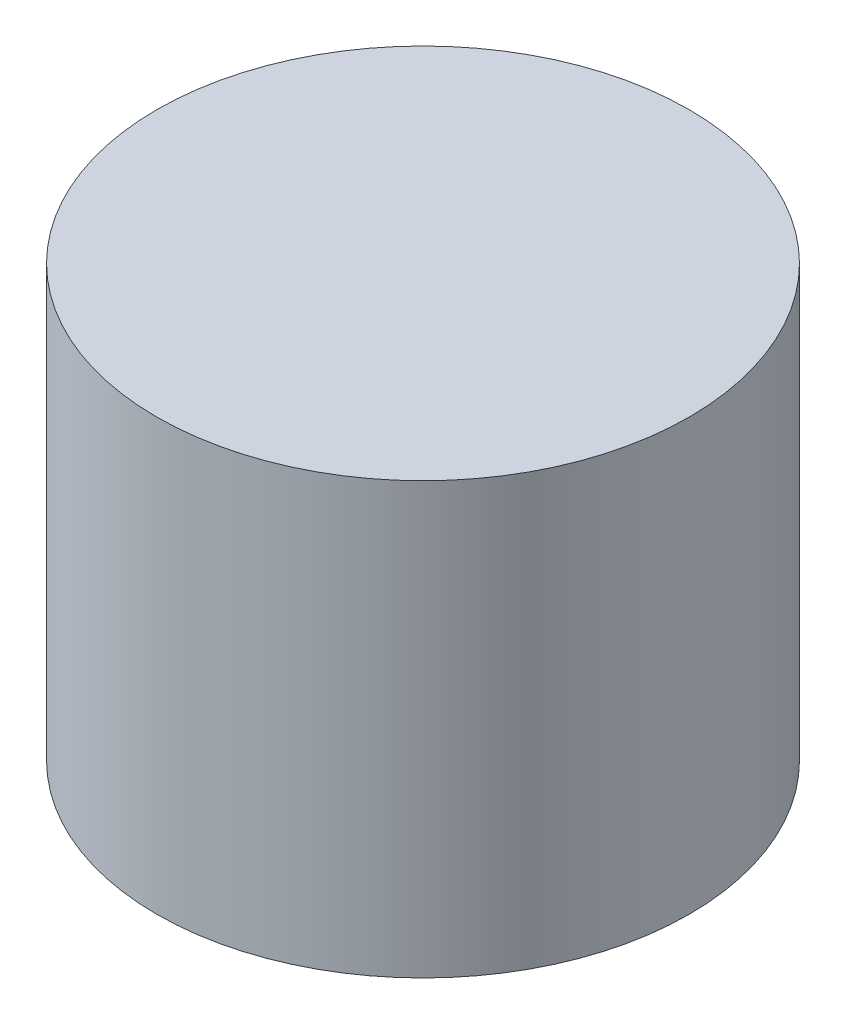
ISO-10303-21;
HEADER;
FILE_DESCRIPTION(('STEP AP214'),'2;1');
FILE_NAME('part.step','',(''),(''),'','','');
FILE_SCHEMA(('AUTOMOTIVE_DESIGN { 1 0 10303 214 1 1 1 1 }'));
ENDSEC;
DATA;
#1=APPLICATION_CONTEXT('core data for automotive mechanical design processes');
#2=APPLICATION_PROTOCOL_DEFINITION('international standard','automotive_design',2000,#1);
#3=PRODUCT_CONTEXT('',#1,'mechanical');
#4=PRODUCT('Part','Part','',(#3));
#5=PRODUCT_RELATED_PRODUCT_CATEGORY('part','',(#4));
#6=PRODUCT_DEFINITION_FORMATION('','',#4);
#7=PRODUCT_DEFINITION_CONTEXT('part definition',#1,'design');
#8=PRODUCT_DEFINITION('design','',#6,#7);
#9=PRODUCT_DEFINITION_SHAPE('','',#8);
#10=(LENGTH_UNIT() NAMED_UNIT(*) SI_UNIT(.MILLI.,.METRE.));
#11=(NAMED_UNIT(*) PLANE_ANGLE_UNIT() SI_UNIT($,.RADIAN.));
#12=(NAMED_UNIT(*) SI_UNIT($,.STERADIAN.) SOLID_ANGLE_UNIT());
#13=UNCERTAINTY_MEASURE_WITH_UNIT(LENGTH_MEASURE(1.E-05),#10,'distance_accuracy_value','');
#14=(GEOMETRIC_REPRESENTATION_CONTEXT(3) GLOBAL_UNCERTAINTY_ASSIGNED_CONTEXT((#13)) GLOBAL_UNIT_ASSIGNED_CONTEXT((#10,
#11,#12)) REPRESENTATION_CONTEXT('',''));
#15=CARTESIAN_POINT('',(0.,0.,0.));
#16=DIRECTION('',(0.,0.,1.));
#17=DIRECTION('',(1.,0.,0.));
#18=AXIS2_PLACEMENT_3D('',#15,#16,#17);
#19=CARTESIAN_POINT('',(1.05,2.75,0.));
#20=DIRECTION('',(0.,1.,0.));
#21=DIRECTION('',(0.,0.,1.));
#22=AXIS2_PLACEMENT_3D('',#19,#20,#21);
#23=PLANE('',#22);
#24=CARTESIAN_POINT('',(0.,2.75,0.));
#25=DIRECTION('',(0.,-1.,0.));
#26=DIRECTION('',(0.,0.,-1.));
#27=AXIS2_PLACEMENT_3D('',#24,#25,#26);
#28=CIRCLE('',#27,1.05);
#29=CARTESIAN_POINT('',(0.,2.75,-1.05));
#30=VERTEX_POINT('',#29);
#31=EDGE_CURVE('E10',#30,#30,#28,.T.);
#32=ORIENTED_EDGE('',*,*,#31,.T.);
#33=EDGE_LOOP('',(#32));
#34=FACE_BOUND('',#33,.T.);
#35=CARTESIAN_POINT('',(0.,2.75,0.));
#36=DIRECTION('',(0.,-1.,0.));
#37=DIRECTION('',(0.,0.,-1.));
#38=AXIS2_PLACEMENT_3D('',#35,#36,#37);
#39=CIRCLE('',#38,2.625);
#40=CARTESIAN_POINT('',(0.,2.75,-2.625));
#41=VERTEX_POINT('',#40);
#42=EDGE_CURVE('E52',#41,#41,#39,.T.);
#43=ORIENTED_EDGE('',*,*,#42,.F.);
#44=EDGE_LOOP('',(#43));
#45=FACE_BOUND('',#44,.T.);
#46=ADVANCED_FACE('F30',(#34,#45),#23,.T.);
#47=CARTESIAN_POINT('',(0.,0.,0.));
#48=DIRECTION('',(0.,-1.,0.));
#49=DIRECTION('',(0.,0.,-1.));
#50=AXIS2_PLACEMENT_3D('',#47,#48,#49);
#51=CYLINDRICAL_SURFACE('',#50,1.05);
#52=CARTESIAN_POINT('',(0.,0.,0.));
#53=DIRECTION('',(0.,-1.,0.));
#54=DIRECTION('',(0.,0.,-1.));
#55=AXIS2_PLACEMENT_3D('',#52,#53,#54);
#56=CIRCLE('',#55,1.05);
#57=CARTESIAN_POINT('',(0.,0.,-1.05));
#58=VERTEX_POINT('',#57);
#59=EDGE_CURVE('E36',#58,#58,#56,.T.);
#60=ORIENTED_EDGE('',*,*,#59,.T.);
#61=EDGE_LOOP('',(#60));
#62=FACE_BOUND('',#61,.T.);
#63=ORIENTED_EDGE('',*,*,#31,.F.);
#64=EDGE_LOOP('',(#63));
#65=FACE_BOUND('',#64,.T.);
#66=ADVANCED_FACE('F60',(#62,#65),#51,.F.);
#67=CARTESIAN_POINT('',(1.05,0.,0.));
#68=DIRECTION('',(0.,-1.,0.));
#69=DIRECTION('',(0.,0.,-1.));
#70=AXIS2_PLACEMENT_3D('',#67,#68,#69);
#71=PLANE('',#70);
#72=CARTESIAN_POINT('',(0.,0.,0.));
#73=DIRECTION('',(0.,-1.,0.));
#74=DIRECTION('',(0.,0.,-1.));
#75=AXIS2_PLACEMENT_3D('',#72,#73,#74);
#76=CIRCLE('',#75,3.4);
#77=CARTESIAN_POINT('',(0.,0.,-3.4));
#78=VERTEX_POINT('',#77);
#79=EDGE_CURVE('E40',#78,#78,#76,.T.);
#80=ORIENTED_EDGE('',*,*,#79,.T.);
#81=EDGE_LOOP('',(#80));
#82=FACE_BOUND('',#81,.T.);
#83=ORIENTED_EDGE('',*,*,#59,.F.);
#84=EDGE_LOOP('',(#83));
#85=FACE_BOUND('',#84,.T.);
#86=ADVANCED_FACE('F64',(#82,#85),#71,.T.);
#87=CARTESIAN_POINT('',(0.,0.,0.));
#88=DIRECTION('',(0.,-1.,0.));
#89=DIRECTION('',(0.,0.,-1.));
#90=AXIS2_PLACEMENT_3D('',#87,#88,#89);
#91=CYLINDRICAL_SURFACE('',#90,3.4);
#92=CARTESIAN_POINT('',(0.,5.5,0.));
#93=DIRECTION('',(0.,-1.,0.));
#94=DIRECTION('',(0.,0.,-1.));
#95=AXIS2_PLACEMENT_3D('',#92,#93,#94);
#96=CIRCLE('',#95,3.4);
#97=CARTESIAN_POINT('',(0.,5.5,-3.4));
#98=VERTEX_POINT('',#97);
#99=EDGE_CURVE('E44',#98,#98,#96,.T.);
#100=ORIENTED_EDGE('',*,*,#99,.T.);
#101=EDGE_LOOP('',(#100));
#102=FACE_BOUND('',#101,.T.);
#103=ORIENTED_EDGE('',*,*,#79,.F.);
#104=EDGE_LOOP('',(#103));
#105=FACE_BOUND('',#104,.T.);
#106=ADVANCED_FACE('F68',(#102,#105),#91,.T.);
#107=CARTESIAN_POINT('',(3.4,5.5,0.));
#108=DIRECTION('',(0.,1.,0.));
#109=DIRECTION('',(0.,0.,1.));
#110=AXIS2_PLACEMENT_3D('',#107,#108,#109);
#111=PLANE('',#110);
#112=ORIENTED_EDGE('',*,*,#99,.F.);
#113=EDGE_LOOP('',(#112));
#114=FACE_BOUND('',#113,.T.);
#115=ADVANCED_FACE('F75',(#114),#111,.T.);
#116=CARTESIAN_POINT('',(2.625,4.15,0.));
#117=DIRECTION('',(0.,-1.,0.));
#118=DIRECTION('',(0.,0.,-1.));
#119=AXIS2_PLACEMENT_3D('',#116,#117,#118);
#120=PLANE('',#119);
#121=CARTESIAN_POINT('',(0.,4.15,0.));
#122=DIRECTION('',(0.,-1.,0.));
#123=DIRECTION('',(0.,0.,-1.));
#124=AXIS2_PLACEMENT_3D('',#121,#122,#123);
#125=CIRCLE('',#124,2.625);
#126=CARTESIAN_POINT('',(0.,4.15,-2.625));
#127=VERTEX_POINT('',#126);
#128=EDGE_CURVE('E49',#127,#127,#125,.T.);
#129=ORIENTED_EDGE('',*,*,#128,.T.);
#130=EDGE_LOOP('',(#129));
#131=FACE_BOUND('',#130,.T.);
#132=ADVANCED_FACE('F79',(#131),#120,.T.);
#133=CARTESIAN_POINT('',(0.,0.,0.));
#134=DIRECTION('',(0.,-1.,0.));
#135=DIRECTION('',(0.,0.,-1.));
#136=AXIS2_PLACEMENT_3D('',#133,#134,#135);
#137=CYLINDRICAL_SURFACE('',#136,2.625);
#138=ORIENTED_EDGE('',*,*,#42,.T.);
#139=EDGE_LOOP('',(#138));
#140=FACE_BOUND('',#139,.T.);
#141=ORIENTED_EDGE('',*,*,#128,.F.);
#142=EDGE_LOOP('',(#141));
#143=FACE_BOUND('',#142,.T.);
#144=ADVANCED_FACE('F56',(#140,#143),#137,.F.);
#145=CLOSED_SHELL('',(#46,#66,#86,#106,#115,#132,#144));
#146=MANIFOLD_SOLID_BREP('B2',#145);
#147=ADVANCED_BREP_SHAPE_REPRESENTATION('',(#18,#146),#14);
#148=SHAPE_DEFINITION_REPRESENTATION(#9,#147);
ENDSEC;
END-ISO-10303-21;
